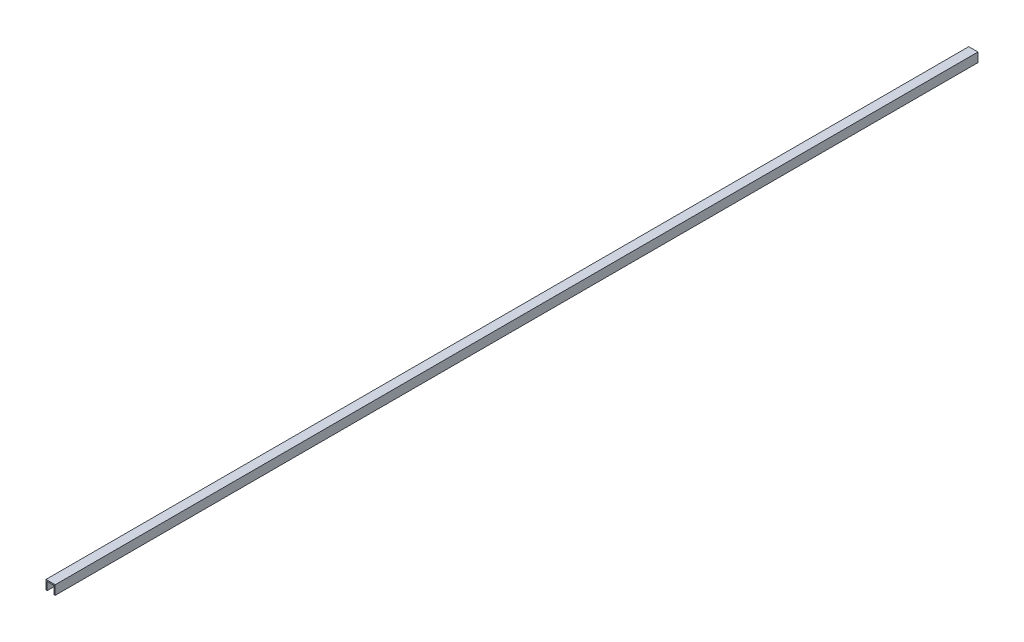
ISO-10303-21;
HEADER;
FILE_DESCRIPTION(('STEP AP214'),'2;1');
FILE_NAME('part.step','',(''),(''),'','','');
FILE_SCHEMA(('AUTOMOTIVE_DESIGN { 1 0 10303 214 1 1 1 1 }'));
ENDSEC;
DATA;
#1=APPLICATION_CONTEXT('core data for automotive mechanical design processes');
#2=APPLICATION_PROTOCOL_DEFINITION('international standard','automotive_design',2000,#1);
#3=PRODUCT_CONTEXT('',#1,'mechanical');
#4=PRODUCT('Part','Part','',(#3));
#5=PRODUCT_RELATED_PRODUCT_CATEGORY('part','',(#4));
#6=PRODUCT_DEFINITION_FORMATION('','',#4);
#7=PRODUCT_DEFINITION_CONTEXT('part definition',#1,'design');
#8=PRODUCT_DEFINITION('design','',#6,#7);
#9=PRODUCT_DEFINITION_SHAPE('','',#8);
#10=(LENGTH_UNIT() NAMED_UNIT(*) SI_UNIT(.MILLI.,.METRE.));
#11=(NAMED_UNIT(*) PLANE_ANGLE_UNIT() SI_UNIT($,.RADIAN.));
#12=(NAMED_UNIT(*) SI_UNIT($,.STERADIAN.) SOLID_ANGLE_UNIT());
#13=UNCERTAINTY_MEASURE_WITH_UNIT(LENGTH_MEASURE(1.E-05),#10,'distance_accuracy_value','');
#14=(GEOMETRIC_REPRESENTATION_CONTEXT(3) GLOBAL_UNCERTAINTY_ASSIGNED_CONTEXT((#13)) GLOBAL_UNIT_ASSIGNED_CONTEXT((#10,
#11,#12)) REPRESENTATION_CONTEXT('',''));
#15=CARTESIAN_POINT('',(0.,0.,0.));
#16=DIRECTION('',(0.,0.,1.));
#17=DIRECTION('',(1.,0.,0.));
#18=AXIS2_PLACEMENT_3D('',#15,#16,#17);
#19=CARTESIAN_POINT('',(4.,-4.,400.));
#20=DIRECTION('',(0.,-1.,0.));
#21=DIRECTION('',(1.,0.,0.));
#22=AXIS2_PLACEMENT_3D('',#19,#20,#21);
#23=PLANE('',#22);
#24=DIRECTION('',(-1.,0.,0.));
#25=VECTOR('',#24,1.);
#26=CARTESIAN_POINT('',(4.,-4.,400.));
#27=LINE('',#26,#25);
#28=CARTESIAN_POINT('',(4.,-4.,400.));
#29=VERTEX_POINT('',#28);
#30=CARTESIAN_POINT('',(3.,-4.,400.));
#31=VERTEX_POINT('',#30);
#32=EDGE_CURVE('E123',#29,#31,#27,.T.);
#33=ORIENTED_EDGE('',*,*,#32,.T.);
#34=DIRECTION('',(0.,0.,-1.));
#35=VECTOR('',#34,1.);
#36=CARTESIAN_POINT('',(3.,-4.,400.));
#37=LINE('',#36,#35);
#38=CARTESIAN_POINT('',(3.,-4.,-400.));
#39=VERTEX_POINT('',#38);
#40=EDGE_CURVE('E112',#31,#39,#37,.T.);
#41=ORIENTED_EDGE('',*,*,#40,.T.);
#42=DIRECTION('',(-1.,0.,0.));
#43=VECTOR('',#42,1.);
#44=CARTESIAN_POINT('',(4.,-4.,-400.));
#45=LINE('',#44,#43);
#46=CARTESIAN_POINT('',(4.,-4.,-400.));
#47=VERTEX_POINT('',#46);
#48=EDGE_CURVE('E121',#47,#39,#45,.T.);
#49=ORIENTED_EDGE('',*,*,#48,.F.);
#50=DIRECTION('',(0.,0.,-1.));
#51=VECTOR('',#50,1.);
#52=CARTESIAN_POINT('',(4.,-4.,400.));
#53=LINE('',#52,#51);
#54=EDGE_CURVE('E59',#29,#47,#53,.T.);
#55=ORIENTED_EDGE('',*,*,#54,.F.);
#56=EDGE_LOOP('',(#33,#41,#49,#55));
#57=FACE_BOUND('',#56,.T.);
#58=ADVANCED_FACE('F35',(#57),#23,.T.);
#59=CARTESIAN_POINT('',(4.,-4.,400.));
#60=DIRECTION('',(-1.,0.,0.));
#61=DIRECTION('',(0.,0.,1.));
#62=AXIS2_PLACEMENT_3D('',#59,#60,#61);
#63=PLANE('',#62);
#64=DIRECTION('',(0.,1.,0.));
#65=VECTOR('',#64,1.);
#66=CARTESIAN_POINT('',(4.,-4.,-400.));
#67=LINE('',#66,#65);
#68=CARTESIAN_POINT('',(4.,4.,-400.));
#69=VERTEX_POINT('',#68);
#70=EDGE_CURVE('E128',#47,#69,#67,.T.);
#71=ORIENTED_EDGE('',*,*,#70,.T.);
#72=DIRECTION('',(0.,0.,-1.));
#73=VECTOR('',#72,1.);
#74=CARTESIAN_POINT('',(4.,4.,400.));
#75=LINE('',#74,#73);
#76=CARTESIAN_POINT('',(4.,4.,400.));
#77=VERTEX_POINT('',#76);
#78=EDGE_CURVE('E11',#77,#69,#75,.T.);
#79=ORIENTED_EDGE('',*,*,#78,.F.);
#80=DIRECTION('',(0.,1.,0.));
#81=VECTOR('',#80,1.);
#82=CARTESIAN_POINT('',(4.,-4.,400.));
#83=LINE('',#82,#81);
#84=EDGE_CURVE('E129',#29,#77,#83,.T.);
#85=ORIENTED_EDGE('',*,*,#84,.F.);
#86=ORIENTED_EDGE('',*,*,#54,.T.);
#87=EDGE_LOOP('',(#71,#79,#85,#86));
#88=FACE_BOUND('',#87,.T.);
#89=ADVANCED_FACE('F37',(#88),#63,.F.);
#90=CARTESIAN_POINT('',(4.,4.,400.));
#91=DIRECTION('',(0.,-1.,0.));
#92=DIRECTION('',(1.,0.,0.));
#93=AXIS2_PLACEMENT_3D('',#90,#91,#92);
#94=PLANE('',#93);
#95=DIRECTION('',(-1.,0.,0.));
#96=VECTOR('',#95,1.);
#97=CARTESIAN_POINT('',(4.,4.,-400.));
#98=LINE('',#97,#96);
#99=CARTESIAN_POINT('',(-4.,4.,-400.));
#100=VERTEX_POINT('',#99);
#101=EDGE_CURVE('E149',#69,#100,#98,.T.);
#102=ORIENTED_EDGE('',*,*,#101,.T.);
#103=DIRECTION('',(0.,0.,-1.));
#104=VECTOR('',#103,1.);
#105=CARTESIAN_POINT('',(-4.,4.,400.));
#106=LINE('',#105,#104);
#107=CARTESIAN_POINT('',(-4.,4.,400.));
#108=VERTEX_POINT('',#107);
#109=EDGE_CURVE('E43',#108,#100,#106,.T.);
#110=ORIENTED_EDGE('',*,*,#109,.F.);
#111=DIRECTION('',(-1.,0.,0.));
#112=VECTOR('',#111,1.);
#113=CARTESIAN_POINT('',(4.,4.,400.));
#114=LINE('',#113,#112);
#115=EDGE_CURVE('E85',#77,#108,#114,.T.);
#116=ORIENTED_EDGE('',*,*,#115,.F.);
#117=ORIENTED_EDGE('',*,*,#78,.T.);
#118=EDGE_LOOP('',(#102,#110,#116,#117));
#119=FACE_BOUND('',#118,.T.);
#120=ADVANCED_FACE('F150',(#119),#94,.F.);
#121=CARTESIAN_POINT('',(-4.,-4.,400.));
#122=DIRECTION('',(-1.,0.,0.));
#123=DIRECTION('',(0.,0.,1.));
#124=AXIS2_PLACEMENT_3D('',#121,#122,#123);
#125=PLANE('',#124);
#126=DIRECTION('',(0.,1.,0.));
#127=VECTOR('',#126,1.);
#128=CARTESIAN_POINT('',(-4.,-4.,-400.));
#129=LINE('',#128,#127);
#130=CARTESIAN_POINT('',(-4.,-4.,-400.));
#131=VERTEX_POINT('',#130);
#132=EDGE_CURVE('E133',#131,#100,#129,.T.);
#133=ORIENTED_EDGE('',*,*,#132,.F.);
#134=DIRECTION('',(0.,0.,-1.));
#135=VECTOR('',#134,1.);
#136=CARTESIAN_POINT('',(-4.,-4.,400.));
#137=LINE('',#136,#135);
#138=CARTESIAN_POINT('',(-4.,-4.,400.));
#139=VERTEX_POINT('',#138);
#140=EDGE_CURVE('E138',#139,#131,#137,.T.);
#141=ORIENTED_EDGE('',*,*,#140,.F.);
#142=DIRECTION('',(0.,1.,0.));
#143=VECTOR('',#142,1.);
#144=CARTESIAN_POINT('',(-4.,-4.,400.));
#145=LINE('',#144,#143);
#146=EDGE_CURVE('E148',#139,#108,#145,.T.);
#147=ORIENTED_EDGE('',*,*,#146,.T.);
#148=ORIENTED_EDGE('',*,*,#109,.T.);
#149=EDGE_LOOP('',(#133,#141,#147,#148));
#150=FACE_BOUND('',#149,.T.);
#151=ADVANCED_FACE('F144',(#150),#125,.T.);
#152=DIRECTION('',(0.,0.,-1.));
#153=VECTOR('',#152,1.);
#154=CARTESIAN_POINT('',(-3.,-4.,400.));
#155=LINE('',#154,#153);
#156=CARTESIAN_POINT('',(-3.,-4.,400.));
#157=VERTEX_POINT('',#156);
#158=CARTESIAN_POINT('',(-3.,-4.,-400.));
#159=VERTEX_POINT('',#158);
#160=EDGE_CURVE('E124',#157,#159,#155,.T.);
#161=ORIENTED_EDGE('',*,*,#160,.F.);
#162=EDGE_CURVE('E157',#157,#139,#27,.T.);
#163=ORIENTED_EDGE('',*,*,#162,.T.);
#164=ORIENTED_EDGE('',*,*,#140,.T.);
#165=EDGE_CURVE('E130',#159,#131,#45,.T.);
#166=ORIENTED_EDGE('',*,*,#165,.F.);
#167=EDGE_LOOP('',(#161,#163,#164,#166));
#168=FACE_BOUND('',#167,.T.);
#169=ADVANCED_FACE('F155',(#168),#23,.T.);
#170=CARTESIAN_POINT('',(0.,0.,400.));
#171=DIRECTION('',(0.,0.,1.));
#172=DIRECTION('',(1.,0.,0.));
#173=AXIS2_PLACEMENT_3D('',#170,#171,#172);
#174=PLANE('',#173);
#175=DIRECTION('',(0.,1.,0.));
#176=VECTOR('',#175,1.);
#177=CARTESIAN_POINT('',(3.,-4.,400.));
#178=LINE('',#177,#176);
#179=CARTESIAN_POINT('',(3.,3.,400.));
#180=VERTEX_POINT('',#179);
#181=EDGE_CURVE('E169',#31,#180,#178,.T.);
#182=ORIENTED_EDGE('',*,*,#181,.F.);
#183=ORIENTED_EDGE('',*,*,#32,.F.);
#184=ORIENTED_EDGE('',*,*,#84,.T.);
#185=ORIENTED_EDGE('',*,*,#115,.T.);
#186=ORIENTED_EDGE('',*,*,#146,.F.);
#187=ORIENTED_EDGE('',*,*,#162,.F.);
#188=DIRECTION('',(0.,1.,0.));
#189=VECTOR('',#188,1.);
#190=CARTESIAN_POINT('',(-3.,-4.,400.));
#191=LINE('',#190,#189);
#192=CARTESIAN_POINT('',(-3.,3.,400.));
#193=VERTEX_POINT('',#192);
#194=EDGE_CURVE('E125',#157,#193,#191,.T.);
#195=ORIENTED_EDGE('',*,*,#194,.T.);
#196=DIRECTION('',(-1.,0.,0.));
#197=VECTOR('',#196,1.);
#198=CARTESIAN_POINT('',(4.,3.,400.));
#199=LINE('',#198,#197);
#200=EDGE_CURVE('E171',#180,#193,#199,.T.);
#201=ORIENTED_EDGE('',*,*,#200,.F.);
#202=EDGE_LOOP('',(#182,#183,#184,#185,#186,#187,#195,#201));
#203=FACE_BOUND('',#202,.T.);
#204=ADVANCED_FACE('F159',(#203),#174,.T.);
#205=CARTESIAN_POINT('',(0.,0.,-400.));
#206=DIRECTION('',(0.,0.,1.));
#207=DIRECTION('',(1.,0.,0.));
#208=AXIS2_PLACEMENT_3D('',#205,#206,#207);
#209=PLANE('',#208);
#210=ORIENTED_EDGE('',*,*,#48,.T.);
#211=DIRECTION('',(0.,1.,0.));
#212=VECTOR('',#211,1.);
#213=CARTESIAN_POINT('',(3.,-4.,-400.));
#214=LINE('',#213,#212);
#215=CARTESIAN_POINT('',(3.,3.,-400.));
#216=VERTEX_POINT('',#215);
#217=EDGE_CURVE('E109',#39,#216,#214,.T.);
#218=ORIENTED_EDGE('',*,*,#217,.T.);
#219=DIRECTION('',(-1.,0.,0.));
#220=VECTOR('',#219,1.);
#221=CARTESIAN_POINT('',(4.,3.,-400.));
#222=LINE('',#221,#220);
#223=CARTESIAN_POINT('',(-3.,3.,-400.));
#224=VERTEX_POINT('',#223);
#225=EDGE_CURVE('E119',#216,#224,#222,.T.);
#226=ORIENTED_EDGE('',*,*,#225,.T.);
#227=DIRECTION('',(0.,1.,0.));
#228=VECTOR('',#227,1.);
#229=CARTESIAN_POINT('',(-3.,-4.,-400.));
#230=LINE('',#229,#228);
#231=EDGE_CURVE('E50',#159,#224,#230,.T.);
#232=ORIENTED_EDGE('',*,*,#231,.F.);
#233=ORIENTED_EDGE('',*,*,#165,.T.);
#234=ORIENTED_EDGE('',*,*,#132,.T.);
#235=ORIENTED_EDGE('',*,*,#101,.F.);
#236=ORIENTED_EDGE('',*,*,#70,.F.);
#237=EDGE_LOOP('',(#210,#218,#226,#232,#233,#234,#235,#236));
#238=FACE_BOUND('',#237,.T.);
#239=ADVANCED_FACE('F127',(#238),#209,.F.);
#240=CARTESIAN_POINT('',(3.,-4.,400.));
#241=DIRECTION('',(-1.,0.,0.));
#242=DIRECTION('',(0.,0.,1.));
#243=AXIS2_PLACEMENT_3D('',#240,#241,#242);
#244=PLANE('',#243);
#245=ORIENTED_EDGE('',*,*,#217,.F.);
#246=ORIENTED_EDGE('',*,*,#40,.F.);
#247=ORIENTED_EDGE('',*,*,#181,.T.);
#248=DIRECTION('',(0.,0.,-1.));
#249=VECTOR('',#248,1.);
#250=CARTESIAN_POINT('',(3.,3.,400.));
#251=LINE('',#250,#249);
#252=EDGE_CURVE('E115',#180,#216,#251,.T.);
#253=ORIENTED_EDGE('',*,*,#252,.T.);
#254=EDGE_LOOP('',(#245,#246,#247,#253));
#255=FACE_BOUND('',#254,.T.);
#256=ADVANCED_FACE('F111',(#255),#244,.T.);
#257=CARTESIAN_POINT('',(4.,3.,400.));
#258=DIRECTION('',(0.,-1.,0.));
#259=DIRECTION('',(1.,0.,0.));
#260=AXIS2_PLACEMENT_3D('',#257,#258,#259);
#261=PLANE('',#260);
#262=ORIENTED_EDGE('',*,*,#225,.F.);
#263=ORIENTED_EDGE('',*,*,#252,.F.);
#264=ORIENTED_EDGE('',*,*,#200,.T.);
#265=DIRECTION('',(0.,0.,-1.));
#266=VECTOR('',#265,1.);
#267=CARTESIAN_POINT('',(-3.,3.,400.));
#268=LINE('',#267,#266);
#269=EDGE_CURVE('E165',#193,#224,#268,.T.);
#270=ORIENTED_EDGE('',*,*,#269,.T.);
#271=EDGE_LOOP('',(#262,#263,#264,#270));
#272=FACE_BOUND('',#271,.T.);
#273=ADVANCED_FACE('F177',(#272),#261,.T.);
#274=CARTESIAN_POINT('',(-3.,-4.,400.));
#275=DIRECTION('',(-1.,0.,0.));
#276=DIRECTION('',(0.,0.,1.));
#277=AXIS2_PLACEMENT_3D('',#274,#275,#276);
#278=PLANE('',#277);
#279=ORIENTED_EDGE('',*,*,#231,.T.);
#280=ORIENTED_EDGE('',*,*,#269,.F.);
#281=ORIENTED_EDGE('',*,*,#194,.F.);
#282=ORIENTED_EDGE('',*,*,#160,.T.);
#283=EDGE_LOOP('',(#279,#280,#281,#282));
#284=FACE_BOUND('',#283,.T.);
#285=ADVANCED_FACE('F179',(#284),#278,.F.);
#286=CLOSED_SHELL('',(#58,#89,#120,#151,#169,#204,#239,#256,#273,#285));
#287=MANIFOLD_SOLID_BREP('B2',#286);
#288=ADVANCED_BREP_SHAPE_REPRESENTATION('',(#18,#287),#14);
#289=SHAPE_DEFINITION_REPRESENTATION(#9,#288);
ENDSEC;
END-ISO-10303-21;
